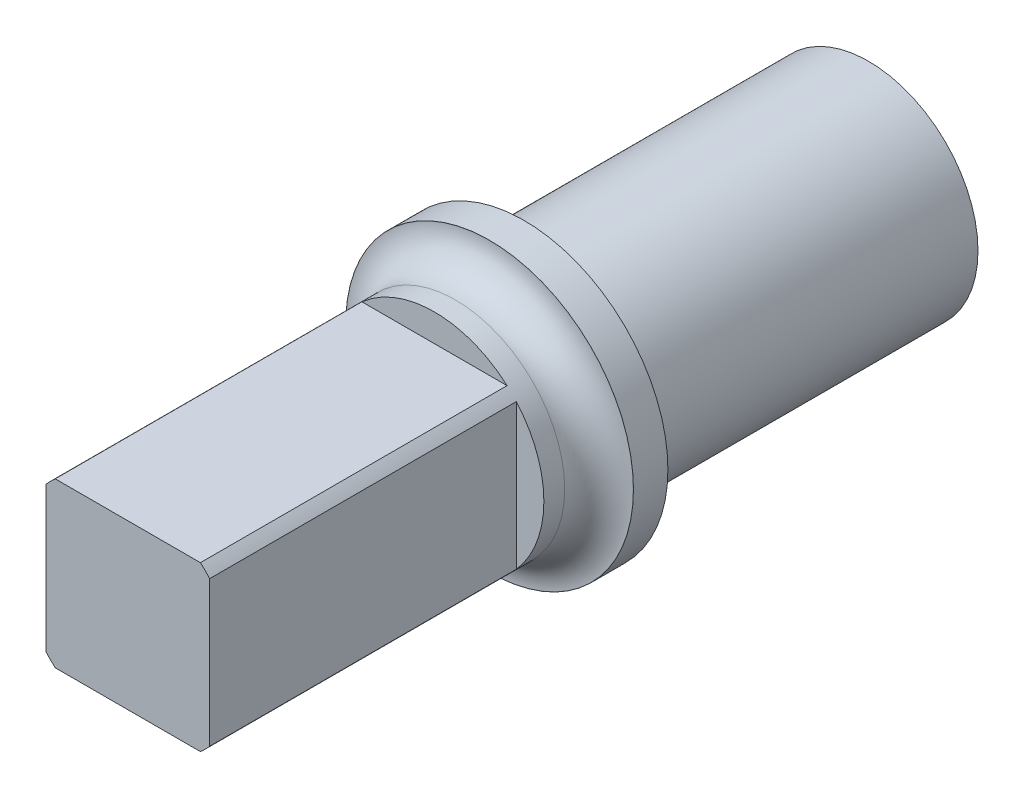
ISO-10303-21;
HEADER;
FILE_DESCRIPTION(('STEP AP214'),'2;1');
FILE_NAME('part.step','',(''),(''),'','','');
FILE_SCHEMA(('AUTOMOTIVE_DESIGN { 1 0 10303 214 1 1 1 1 }'));
ENDSEC;
DATA;
#1=APPLICATION_CONTEXT('core data for automotive mechanical design processes');
#2=APPLICATION_PROTOCOL_DEFINITION('international standard','automotive_design',2000,#1);
#3=PRODUCT_CONTEXT('',#1,'mechanical');
#4=PRODUCT('Part','Part','',(#3));
#5=PRODUCT_RELATED_PRODUCT_CATEGORY('part','',(#4));
#6=PRODUCT_DEFINITION_FORMATION('','',#4);
#7=PRODUCT_DEFINITION_CONTEXT('part definition',#1,'design');
#8=PRODUCT_DEFINITION('design','',#6,#7);
#9=PRODUCT_DEFINITION_SHAPE('','',#8);
#10=(LENGTH_UNIT() NAMED_UNIT(*) SI_UNIT(.MILLI.,.METRE.));
#11=(NAMED_UNIT(*) PLANE_ANGLE_UNIT() SI_UNIT($,.RADIAN.));
#12=(NAMED_UNIT(*) SI_UNIT($,.STERADIAN.) SOLID_ANGLE_UNIT());
#13=UNCERTAINTY_MEASURE_WITH_UNIT(LENGTH_MEASURE(1.E-05),#10,'distance_accuracy_value','');
#14=(GEOMETRIC_REPRESENTATION_CONTEXT(3) GLOBAL_UNCERTAINTY_ASSIGNED_CONTEXT((#13)) GLOBAL_UNIT_ASSIGNED_CONTEXT((#10,
#11,#12)) REPRESENTATION_CONTEXT('',''));
#15=CARTESIAN_POINT('',(0.,0.,0.));
#16=DIRECTION('',(0.,0.,1.));
#17=DIRECTION('',(1.,0.,0.));
#18=AXIS2_PLACEMENT_3D('',#15,#16,#17);
#19=CARTESIAN_POINT('',(0.,6.34999999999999,0.));
#20=DIRECTION('',(0.,0.,-1.));
#21=DIRECTION('',(-1.,0.,0.));
#22=AXIS2_PLACEMENT_3D('',#19,#20,#21);
#23=PLANE('',#22);
#24=DIRECTION('',(0.,-1.,0.));
#25=VECTOR('',#24,1.);
#26=CARTESIAN_POINT('',(-4.75,4.75,0.));
#27=LINE('',#26,#25);
#28=CARTESIAN_POINT('',(-4.75,4.21426150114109,0.));
#29=VERTEX_POINT('',#28);
#30=CARTESIAN_POINT('',(-4.75,-4.21426150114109,0.));
#31=VERTEX_POINT('',#30);
#32=EDGE_CURVE('E110',#29,#31,#27,.T.);
#33=ORIENTED_EDGE('',*,*,#32,.T.);
#34=CARTESIAN_POINT('',(0.,0.,0.));
#35=DIRECTION('',(0.,0.,1.));
#36=DIRECTION('',(1.,0.,0.));
#37=AXIS2_PLACEMENT_3D('',#34,#35,#36);
#38=CIRCLE('',#37,6.34999999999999);
#39=CARTESIAN_POINT('',(-4.21426150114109,-4.75,0.));
#40=VERTEX_POINT('',#39);
#41=EDGE_CURVE('E109',#31,#40,#38,.T.);
#42=ORIENTED_EDGE('',*,*,#41,.T.);
#43=DIRECTION('',(1.,0.,0.));
#44=VECTOR('',#43,1.);
#45=CARTESIAN_POINT('',(4.75,-4.75,0.));
#46=LINE('',#45,#44);
#47=CARTESIAN_POINT('',(4.21426150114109,-4.75,0.));
#48=VERTEX_POINT('',#47);
#49=EDGE_CURVE('E53',#40,#48,#46,.T.);
#50=ORIENTED_EDGE('',*,*,#49,.T.);
#51=CARTESIAN_POINT('',(4.75,-4.21426150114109,0.));
#52=VERTEX_POINT('',#51);
#53=EDGE_CURVE('E107',#48,#52,#38,.T.);
#54=ORIENTED_EDGE('',*,*,#53,.T.);
#55=DIRECTION('',(0.,1.,0.));
#56=VECTOR('',#55,1.);
#57=CARTESIAN_POINT('',(4.75,4.75,0.));
#58=LINE('',#57,#56);
#59=CARTESIAN_POINT('',(4.75,4.21426150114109,0.));
#60=VERTEX_POINT('',#59);
#61=EDGE_CURVE('E45',#52,#60,#58,.T.);
#62=ORIENTED_EDGE('',*,*,#61,.T.);
#63=CARTESIAN_POINT('',(4.21426150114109,4.75,0.));
#64=VERTEX_POINT('',#63);
#65=EDGE_CURVE('E117',#60,#64,#38,.T.);
#66=ORIENTED_EDGE('',*,*,#65,.T.);
#67=DIRECTION('',(-1.,0.,0.));
#68=VECTOR('',#67,1.);
#69=CARTESIAN_POINT('',(4.75,4.75,0.));
#70=LINE('',#69,#68);
#71=CARTESIAN_POINT('',(-4.21426150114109,4.75,0.));
#72=VERTEX_POINT('',#71);
#73=EDGE_CURVE('E129',#64,#72,#70,.T.);
#74=ORIENTED_EDGE('',*,*,#73,.T.);
#75=EDGE_CURVE('E118',#72,#29,#38,.T.);
#76=ORIENTED_EDGE('',*,*,#75,.T.);
#77=EDGE_LOOP('',(#33,#42,#50,#54,#62,#66,#74,#76));
#78=FACE_BOUND('',#77,.T.);
#79=ADVANCED_FACE('F31',(#78),#23,.F.);
#80=CARTESIAN_POINT('',(0.,0.,0.));
#81=DIRECTION('',(0.,0.,1.));
#82=DIRECTION('',(1.,0.,0.));
#83=AXIS2_PLACEMENT_3D('',#80,#81,#82);
#84=CYLINDRICAL_SURFACE('',#83,6.35);
#85=CARTESIAN_POINT('',(0.,0.,-19.01));
#86=DIRECTION('',(0.,0.,1.));
#87=DIRECTION('',(1.,0.,0.));
#88=AXIS2_PLACEMENT_3D('',#85,#86,#87);
#89=CIRCLE('',#88,6.35);
#90=CARTESIAN_POINT('',(6.35,0.,-19.01));
#91=VERTEX_POINT('',#90);
#92=EDGE_CURVE('E115',#91,#91,#89,.T.);
#93=ORIENTED_EDGE('',*,*,#92,.T.);
#94=EDGE_LOOP('',(#93));
#95=FACE_BOUND('',#94,.T.);
#96=DIRECTION('',(0.,0.,1.));
#97=VECTOR('',#96,1.);
#98=CARTESIAN_POINT('',(-4.75,-4.21426150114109,0.));
#99=LINE('',#98,#97);
#100=CARTESIAN_POINT('',(-4.75,-4.21426150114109,-17.8));
#101=VERTEX_POINT('',#100);
#102=EDGE_CURVE('E12',#101,#31,#99,.T.);
#103=ORIENTED_EDGE('',*,*,#102,.F.);
#104=CARTESIAN_POINT('',(0.,0.,-17.8));
#105=DIRECTION('',(0.,0.,1.));
#106=DIRECTION('',(1.,0.,0.));
#107=AXIS2_PLACEMENT_3D('',#104,#105,#106);
#108=CIRCLE('',#107,6.35);
#109=CARTESIAN_POINT('',(-4.75,4.21426150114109,-17.8));
#110=VERTEX_POINT('',#109);
#111=EDGE_CURVE('E38',#110,#101,#108,.T.);
#112=ORIENTED_EDGE('',*,*,#111,.F.);
#113=DIRECTION('',(0.,0.,1.));
#114=VECTOR('',#113,1.);
#115=CARTESIAN_POINT('',(-4.75,4.21426150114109,0.));
#116=LINE('',#115,#114);
#117=EDGE_CURVE('E135',#29,#110,#116,.F.);
#118=ORIENTED_EDGE('',*,*,#117,.F.);
#119=ORIENTED_EDGE('',*,*,#75,.F.);
#120=DIRECTION('',(0.,0.,1.));
#121=VECTOR('',#120,1.);
#122=CARTESIAN_POINT('',(-4.21426150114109,4.75,0.));
#123=LINE('',#122,#121);
#124=CARTESIAN_POINT('',(-4.21426150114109,4.75,-17.8));
#125=VERTEX_POINT('',#124);
#126=EDGE_CURVE('E133',#125,#72,#123,.T.);
#127=ORIENTED_EDGE('',*,*,#126,.F.);
#128=CARTESIAN_POINT('',(4.21426150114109,4.75,-17.8));
#129=VERTEX_POINT('',#128);
#130=EDGE_CURVE('E140',#129,#125,#108,.T.);
#131=ORIENTED_EDGE('',*,*,#130,.F.);
#132=DIRECTION('',(0.,0.,1.));
#133=VECTOR('',#132,1.);
#134=CARTESIAN_POINT('',(4.21426150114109,4.75,0.));
#135=LINE('',#134,#133);
#136=EDGE_CURVE('E143',#64,#129,#135,.F.);
#137=ORIENTED_EDGE('',*,*,#136,.F.);
#138=ORIENTED_EDGE('',*,*,#65,.F.);
#139=DIRECTION('',(0.,0.,1.));
#140=VECTOR('',#139,1.);
#141=CARTESIAN_POINT('',(4.75,4.21426150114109,0.));
#142=LINE('',#141,#140);
#143=CARTESIAN_POINT('',(4.75,4.21426150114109,-17.8));
#144=VERTEX_POINT('',#143);
#145=EDGE_CURVE('E145',#144,#60,#142,.T.);
#146=ORIENTED_EDGE('',*,*,#145,.F.);
#147=CARTESIAN_POINT('',(4.75,-4.21426150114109,-17.8));
#148=VERTEX_POINT('',#147);
#149=EDGE_CURVE('E147',#148,#144,#108,.T.);
#150=ORIENTED_EDGE('',*,*,#149,.F.);
#151=DIRECTION('',(0.,0.,1.));
#152=VECTOR('',#151,1.);
#153=CARTESIAN_POINT('',(4.75,-4.21426150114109,0.));
#154=LINE('',#153,#152);
#155=EDGE_CURVE('E100',#52,#148,#154,.F.);
#156=ORIENTED_EDGE('',*,*,#155,.F.);
#157=ORIENTED_EDGE('',*,*,#53,.F.);
#158=DIRECTION('',(0.,0.,1.));
#159=VECTOR('',#158,1.);
#160=CARTESIAN_POINT('',(4.21426150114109,-4.75,0.));
#161=LINE('',#160,#159);
#162=CARTESIAN_POINT('',(4.21426150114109,-4.75,-17.8));
#163=VERTEX_POINT('',#162);
#164=EDGE_CURVE('E93',#163,#48,#161,.T.);
#165=ORIENTED_EDGE('',*,*,#164,.F.);
#166=CARTESIAN_POINT('',(-4.21426150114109,-4.75,-17.8));
#167=VERTEX_POINT('',#166);
#168=EDGE_CURVE('E101',#167,#163,#108,.T.);
#169=ORIENTED_EDGE('',*,*,#168,.F.);
#170=DIRECTION('',(0.,0.,1.));
#171=VECTOR('',#170,1.);
#172=CARTESIAN_POINT('',(-4.21426150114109,-4.75,0.));
#173=LINE('',#172,#171);
#174=EDGE_CURVE('E124',#40,#167,#173,.F.);
#175=ORIENTED_EDGE('',*,*,#174,.F.);
#176=ORIENTED_EDGE('',*,*,#41,.F.);
#177=EDGE_LOOP('',(#103,#112,#118,#119,#127,#131,#137,#138,#146,#150,#156,#157,#165,#169,#175,#176));
#178=FACE_BOUND('',#177,.T.);
#179=ADVANCED_FACE('F113',(#95,#178),#84,.T.);
#180=CARTESIAN_POINT('',(0.,0.,-19.01));
#181=DIRECTION('',(0.,0.,1.));
#182=DIRECTION('',(1.,0.,0.));
#183=AXIS2_PLACEMENT_3D('',#180,#181,#182);
#184=TOROIDAL_SURFACE('',#183,8.34,1.99);
#185=ORIENTED_EDGE('',*,*,#92,.F.);
#186=EDGE_LOOP('',(#185));
#187=FACE_BOUND('',#186,.T.);
#188=CARTESIAN_POINT('',(0.,0.,-21.));
#189=DIRECTION('',(0.,0.,1.));
#190=DIRECTION('',(1.,0.,0.));
#191=AXIS2_PLACEMENT_3D('',#188,#189,#190);
#192=CIRCLE('',#191,8.34);
#193=CARTESIAN_POINT('',(8.34,0.,-21.));
#194=VERTEX_POINT('',#193);
#195=EDGE_CURVE('E120',#194,#194,#192,.T.);
#196=ORIENTED_EDGE('',*,*,#195,.T.);
#197=EDGE_LOOP('',(#196));
#198=FACE_BOUND('',#197,.T.);
#199=ADVANCED_FACE('F184',(#187,#198),#184,.F.);
#200=CARTESIAN_POINT('',(0.,8.35,-21.));
#201=DIRECTION('',(0.,0.,-1.));
#202=DIRECTION('',(-1.,0.,0.));
#203=AXIS2_PLACEMENT_3D('',#200,#201,#202);
#204=PLANE('',#203);
#205=ORIENTED_EDGE('',*,*,#195,.F.);
#206=EDGE_LOOP('',(#205));
#207=FACE_BOUND('',#206,.T.);
#208=CARTESIAN_POINT('',(0.,0.,-21.));
#209=DIRECTION('',(0.,0.,1.));
#210=DIRECTION('',(1.,0.,0.));
#211=AXIS2_PLACEMENT_3D('',#208,#209,#210);
#212=CIRCLE('',#211,8.35);
#213=CARTESIAN_POINT('',(8.35,0.,-21.));
#214=VERTEX_POINT('',#213);
#215=EDGE_CURVE('E178',#214,#214,#212,.T.);
#216=ORIENTED_EDGE('',*,*,#215,.T.);
#217=EDGE_LOOP('',(#216));
#218=FACE_BOUND('',#217,.T.);
#219=ADVANCED_FACE('F186',(#207,#218),#204,.F.);
#220=CARTESIAN_POINT('',(0.,0.,0.));
#221=DIRECTION('',(0.,0.,1.));
#222=DIRECTION('',(1.,0.,0.));
#223=AXIS2_PLACEMENT_3D('',#220,#221,#222);
#224=CYLINDRICAL_SURFACE('',#223,8.35);
#225=ORIENTED_EDGE('',*,*,#215,.F.);
#226=EDGE_LOOP('',(#225));
#227=FACE_BOUND('',#226,.T.);
#228=CARTESIAN_POINT('',(0.,0.,-23.));
#229=DIRECTION('',(0.,0.,1.));
#230=DIRECTION('',(1.,0.,0.));
#231=AXIS2_PLACEMENT_3D('',#228,#229,#230);
#232=CIRCLE('',#231,8.35);
#233=CARTESIAN_POINT('',(8.35,0.,-23.));
#234=VERTEX_POINT('',#233);
#235=EDGE_CURVE('E175',#234,#234,#232,.T.);
#236=ORIENTED_EDGE('',*,*,#235,.T.);
#237=EDGE_LOOP('',(#236));
#238=FACE_BOUND('',#237,.T.);
#239=ADVANCED_FACE('F189',(#227,#238),#224,.T.);
#240=CARTESIAN_POINT('',(0.,6.35,-23.));
#241=DIRECTION('',(0.,0.,1.));
#242=DIRECTION('',(1.,0.,0.));
#243=AXIS2_PLACEMENT_3D('',#240,#241,#242);
#244=PLANE('',#243);
#245=ORIENTED_EDGE('',*,*,#235,.F.);
#246=EDGE_LOOP('',(#245));
#247=FACE_BOUND('',#246,.T.);
#248=CARTESIAN_POINT('',(0.,0.,-23.));
#249=DIRECTION('',(0.,0.,1.));
#250=DIRECTION('',(1.,0.,0.));
#251=AXIS2_PLACEMENT_3D('',#248,#249,#250);
#252=CIRCLE('',#251,6.35);
#253=CARTESIAN_POINT('',(6.35,0.,-23.));
#254=VERTEX_POINT('',#253);
#255=EDGE_CURVE('E164',#254,#254,#252,.T.);
#256=ORIENTED_EDGE('',*,*,#255,.T.);
#257=EDGE_LOOP('',(#256));
#258=FACE_BOUND('',#257,.T.);
#259=ADVANCED_FACE('F195',(#247,#258),#244,.F.);
#260=CARTESIAN_POINT('',(0.,0.,0.));
#261=DIRECTION('',(0.,0.,1.));
#262=DIRECTION('',(1.,0.,0.));
#263=AXIS2_PLACEMENT_3D('',#260,#261,#262);
#264=CYLINDRICAL_SURFACE('',#263,6.35);
#265=ORIENTED_EDGE('',*,*,#255,.F.);
#266=EDGE_LOOP('',(#265));
#267=FACE_BOUND('',#266,.T.);
#268=CARTESIAN_POINT('',(0.,0.,-43.));
#269=DIRECTION('',(0.,0.,1.));
#270=DIRECTION('',(1.,0.,0.));
#271=AXIS2_PLACEMENT_3D('',#268,#269,#270);
#272=CIRCLE('',#271,6.35);
#273=CARTESIAN_POINT('',(6.35,0.,-43.));
#274=VERTEX_POINT('',#273);
#275=EDGE_CURVE('E160',#274,#274,#272,.T.);
#276=ORIENTED_EDGE('',*,*,#275,.T.);
#277=EDGE_LOOP('',(#276));
#278=FACE_BOUND('',#277,.T.);
#279=ADVANCED_FACE('F201',(#267,#278),#264,.T.);
#280=CARTESIAN_POINT('',(0.,0.,-43.));
#281=DIRECTION('',(0.,0.,1.));
#282=DIRECTION('',(1.,0.,0.));
#283=AXIS2_PLACEMENT_3D('',#280,#281,#282);
#284=PLANE('',#283);
#285=ORIENTED_EDGE('',*,*,#275,.F.);
#286=EDGE_LOOP('',(#285));
#287=FACE_BOUND('',#286,.T.);
#288=ADVANCED_FACE('F207',(#287),#284,.F.);
#289=CARTESIAN_POINT('',(4.75,-4.75,-17.8));
#290=DIRECTION('',(0.,-1.,0.));
#291=DIRECTION('',(1.,0.,0.));
#292=AXIS2_PLACEMENT_3D('',#289,#290,#291);
#293=PLANE('',#292);
#294=ORIENTED_EDGE('',*,*,#164,.T.);
#295=ORIENTED_EDGE('',*,*,#49,.F.);
#296=ORIENTED_EDGE('',*,*,#174,.T.);
#297=DIRECTION('',(1.,0.,0.));
#298=VECTOR('',#297,1.);
#299=CARTESIAN_POINT('',(4.75,-4.75,-17.8));
#300=LINE('',#299,#298);
#301=EDGE_CURVE('E96',#167,#163,#300,.T.);
#302=ORIENTED_EDGE('',*,*,#301,.T.);
#303=EDGE_LOOP('',(#294,#295,#296,#302));
#304=FACE_BOUND('',#303,.T.);
#305=ADVANCED_FACE('F94',(#304),#293,.T.);
#306=CARTESIAN_POINT('',(0.,0.,-17.8));
#307=DIRECTION('',(0.,0.,1.));
#308=DIRECTION('',(1.,0.,0.));
#309=AXIS2_PLACEMENT_3D('',#306,#307,#308);
#310=PLANE('',#309);
#311=ORIENTED_EDGE('',*,*,#168,.T.);
#312=ORIENTED_EDGE('',*,*,#301,.F.);
#313=EDGE_LOOP('',(#311,#312));
#314=FACE_BOUND('',#313,.T.);
#315=ADVANCED_FACE('F216',(#314),#310,.T.);
#316=CARTESIAN_POINT('',(4.75,4.75,-17.8));
#317=DIRECTION('',(1.,0.,0.));
#318=DIRECTION('',(0.,1.,0.));
#319=AXIS2_PLACEMENT_3D('',#316,#317,#318);
#320=PLANE('',#319);
#321=ORIENTED_EDGE('',*,*,#145,.T.);
#322=ORIENTED_EDGE('',*,*,#61,.F.);
#323=ORIENTED_EDGE('',*,*,#155,.T.);
#324=DIRECTION('',(0.,1.,0.));
#325=VECTOR('',#324,1.);
#326=CARTESIAN_POINT('',(4.75,4.75,-17.8));
#327=LINE('',#326,#325);
#328=EDGE_CURVE('E161',#148,#144,#327,.T.);
#329=ORIENTED_EDGE('',*,*,#328,.T.);
#330=EDGE_LOOP('',(#321,#322,#323,#329));
#331=FACE_BOUND('',#330,.T.);
#332=ADVANCED_FACE('F275',(#331),#320,.T.);
#333=ORIENTED_EDGE('',*,*,#149,.T.);
#334=ORIENTED_EDGE('',*,*,#328,.F.);
#335=EDGE_LOOP('',(#333,#334));
#336=FACE_BOUND('',#335,.T.);
#337=ADVANCED_FACE('F276',(#336),#310,.T.);
#338=CARTESIAN_POINT('',(4.75,4.75,-17.8));
#339=DIRECTION('',(0.,1.,0.));
#340=DIRECTION('',(-1.,0.,0.));
#341=AXIS2_PLACEMENT_3D('',#338,#339,#340);
#342=PLANE('',#341);
#343=ORIENTED_EDGE('',*,*,#126,.T.);
#344=ORIENTED_EDGE('',*,*,#73,.F.);
#345=ORIENTED_EDGE('',*,*,#136,.T.);
#346=DIRECTION('',(-1.,0.,0.));
#347=VECTOR('',#346,1.);
#348=CARTESIAN_POINT('',(4.75,4.75,-17.8));
#349=LINE('',#348,#347);
#350=EDGE_CURVE('E156',#129,#125,#349,.T.);
#351=ORIENTED_EDGE('',*,*,#350,.T.);
#352=EDGE_LOOP('',(#343,#344,#345,#351));
#353=FACE_BOUND('',#352,.T.);
#354=ADVANCED_FACE('F159',(#353),#342,.T.);
#355=ORIENTED_EDGE('',*,*,#130,.T.);
#356=ORIENTED_EDGE('',*,*,#350,.F.);
#357=EDGE_LOOP('',(#355,#356));
#358=FACE_BOUND('',#357,.T.);
#359=ADVANCED_FACE('F155',(#358),#310,.T.);
#360=ORIENTED_EDGE('',*,*,#111,.T.);
#361=DIRECTION('',(0.,-1.,0.));
#362=VECTOR('',#361,1.);
#363=CARTESIAN_POINT('',(-4.75,4.75,-17.8));
#364=LINE('',#363,#362);
#365=EDGE_CURVE('E171',#110,#101,#364,.T.);
#366=ORIENTED_EDGE('',*,*,#365,.F.);
#367=EDGE_LOOP('',(#360,#366));
#368=FACE_BOUND('',#367,.T.);
#369=ADVANCED_FACE('F277',(#368),#310,.T.);
#370=CARTESIAN_POINT('',(-4.75,4.75,-17.8));
#371=DIRECTION('',(-1.,0.,0.));
#372=DIRECTION('',(0.,-1.,0.));
#373=AXIS2_PLACEMENT_3D('',#370,#371,#372);
#374=PLANE('',#373);
#375=ORIENTED_EDGE('',*,*,#102,.T.);
#376=ORIENTED_EDGE('',*,*,#32,.F.);
#377=ORIENTED_EDGE('',*,*,#117,.T.);
#378=ORIENTED_EDGE('',*,*,#365,.T.);
#379=EDGE_LOOP('',(#375,#376,#377,#378));
#380=FACE_BOUND('',#379,.T.);
#381=ADVANCED_FACE('F315',(#380),#374,.T.);
#382=CLOSED_SHELL('',(#79,#179,#199,#219,#239,#259,#279,#288,#305,#315,#332,#337,#354,#359,#369,#381));
#383=MANIFOLD_SOLID_BREP('B2',#382);
#384=ADVANCED_BREP_SHAPE_REPRESENTATION('',(#18,#383),#14);
#385=SHAPE_DEFINITION_REPRESENTATION(#9,#384);
ENDSEC;
END-ISO-10303-21;
